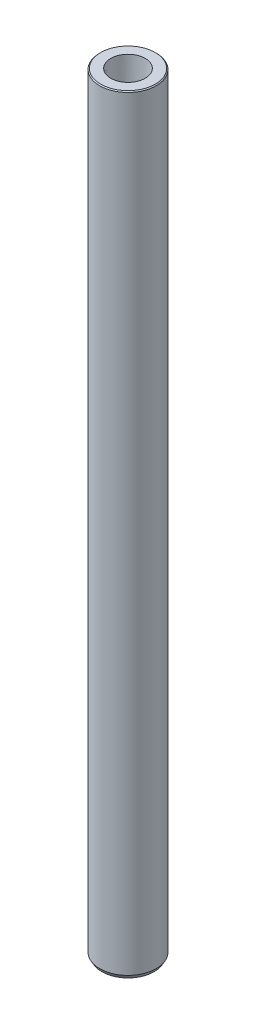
ISO-10303-21;
HEADER;
FILE_DESCRIPTION(('STEP AP214'),'2;1');
FILE_NAME('part.step','',(''),(''),'','','');
FILE_SCHEMA(('AUTOMOTIVE_DESIGN { 1 0 10303 214 1 1 1 1 }'));
ENDSEC;
DATA;
#1=APPLICATION_CONTEXT('core data for automotive mechanical design processes');
#2=APPLICATION_PROTOCOL_DEFINITION('international standard','automotive_design',2000,#1);
#3=PRODUCT_CONTEXT('',#1,'mechanical');
#4=PRODUCT('Part','Part','',(#3));
#5=PRODUCT_RELATED_PRODUCT_CATEGORY('part','',(#4));
#6=PRODUCT_DEFINITION_FORMATION('','',#4);
#7=PRODUCT_DEFINITION_CONTEXT('part definition',#1,'design');
#8=PRODUCT_DEFINITION('design','',#6,#7);
#9=PRODUCT_DEFINITION_SHAPE('','',#8);
#10=(LENGTH_UNIT() NAMED_UNIT(*) SI_UNIT(.MILLI.,.METRE.));
#11=(NAMED_UNIT(*) PLANE_ANGLE_UNIT() SI_UNIT($,.RADIAN.));
#12=(NAMED_UNIT(*) SI_UNIT($,.STERADIAN.) SOLID_ANGLE_UNIT());
#13=UNCERTAINTY_MEASURE_WITH_UNIT(LENGTH_MEASURE(1.E-05),#10,'distance_accuracy_value','');
#14=(GEOMETRIC_REPRESENTATION_CONTEXT(3) GLOBAL_UNCERTAINTY_ASSIGNED_CONTEXT((#13)) GLOBAL_UNIT_ASSIGNED_CONTEXT((#10,
#11,#12)) REPRESENTATION_CONTEXT('',''));
#15=CARTESIAN_POINT('',(0.,0.,0.));
#16=DIRECTION('',(0.,0.,1.));
#17=DIRECTION('',(1.,0.,0.));
#18=AXIS2_PLACEMENT_3D('',#15,#16,#17);
#19=CARTESIAN_POINT('',(0.,204.,0.));
#20=DIRECTION('',(0.,-1.,0.));
#21=DIRECTION('',(0.,0.,-1.));
#22=AXIS2_PLACEMENT_3D('',#19,#20,#21);
#23=CYLINDRICAL_SURFACE('',#22,7.5);
#24=CARTESIAN_POINT('',(0.,203.75,0.));
#25=DIRECTION('',(0.,1.,0.));
#26=DIRECTION('',(0.,0.,1.));
#27=AXIS2_PLACEMENT_3D('',#24,#25,#26);
#28=CIRCLE('',#27,7.5);
#29=CARTESIAN_POINT('',(0.,203.75,7.5));
#30=VERTEX_POINT('',#29);
#31=EDGE_CURVE('E9183',#30,#30,#28,.F.);
#32=ORIENTED_EDGE('',*,*,#31,.T.);
#33=EDGE_LOOP('',(#32));
#34=FACE_BOUND('',#33,.T.);
#35=CARTESIAN_POINT('',(0.,1.00000000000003,0.));
#36=DIRECTION('',(0.,1.,0.));
#37=DIRECTION('',(0.,0.,1.));
#38=AXIS2_PLACEMENT_3D('',#35,#36,#37);
#39=CIRCLE('',#38,7.5);
#40=CARTESIAN_POINT('',(0.,1.00000000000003,7.5));
#41=VERTEX_POINT('',#40);
#42=EDGE_CURVE('E9198',#41,#41,#39,.T.);
#43=ORIENTED_EDGE('',*,*,#42,.T.);
#44=EDGE_LOOP('',(#43));
#45=FACE_BOUND('',#44,.T.);
#46=ADVANCED_FACE('F9172',(#34,#45),#23,.T.);
#47=CARTESIAN_POINT('',(0.,204.,0.));
#48=DIRECTION('',(0.,1.,0.));
#49=DIRECTION('',(0.,0.,1.));
#50=AXIS2_PLACEMENT_3D('',#47,#48,#49);
#51=PLANE('',#50);
#52=CARTESIAN_POINT('',(0.,204.,0.));
#53=DIRECTION('',(0.,1.,0.));
#54=DIRECTION('',(0.,0.,1.));
#55=AXIS2_PLACEMENT_3D('',#52,#53,#54);
#56=CIRCLE('',#55,4.5735);
#57=CARTESIAN_POINT('',(0.,204.,4.5735));
#58=VERTEX_POINT('',#57);
#59=EDGE_CURVE('E9206',#58,#58,#56,.T.);
#60=ORIENTED_EDGE('',*,*,#59,.F.);
#61=EDGE_LOOP('',(#60));
#62=FACE_BOUND('',#61,.T.);
#63=CARTESIAN_POINT('',(0.,204.,0.));
#64=DIRECTION('',(0.,1.,0.));
#65=DIRECTION('',(0.,0.,1.));
#66=AXIS2_PLACEMENT_3D('',#63,#64,#65);
#67=CIRCLE('',#66,7.25);
#68=CARTESIAN_POINT('',(0.,204.,7.25));
#69=VERTEX_POINT('',#68);
#70=EDGE_CURVE('E9192',#69,#69,#67,.T.);
#71=ORIENTED_EDGE('',*,*,#70,.T.);
#72=EDGE_LOOP('',(#71));
#73=FACE_BOUND('',#72,.T.);
#74=ADVANCED_FACE('F9212',(#62,#73),#51,.T.);
#75=CARTESIAN_POINT('',(0.,0.,0.));
#76=DIRECTION('',(0.,1.,0.));
#77=DIRECTION('',(0.,0.,1.));
#78=AXIS2_PLACEMENT_3D('',#75,#76,#77);
#79=PLANE('',#78);
#80=CARTESIAN_POINT('',(0.,0.,0.));
#81=DIRECTION('',(0.,1.,0.));
#82=DIRECTION('',(0.,0.,1.));
#83=AXIS2_PLACEMENT_3D('',#80,#81,#82);
#84=CIRCLE('',#83,4.75);
#85=CARTESIAN_POINT('',(0.,0.,4.75));
#86=VERTEX_POINT('',#85);
#87=EDGE_CURVE('E10',#86,#86,#84,.T.);
#88=ORIENTED_EDGE('',*,*,#87,.T.);
#89=EDGE_LOOP('',(#88));
#90=FACE_BOUND('',#89,.T.);
#91=CARTESIAN_POINT('',(0.,0.,0.));
#92=DIRECTION('',(0.,1.,0.));
#93=DIRECTION('',(0.,0.,1.));
#94=AXIS2_PLACEMENT_3D('',#91,#92,#93);
#95=CIRCLE('',#94,6.92264973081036);
#96=CARTESIAN_POINT('',(0.,0.,6.92264973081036));
#97=VERTEX_POINT('',#96);
#98=EDGE_CURVE('E9195',#97,#97,#95,.F.);
#99=ORIENTED_EDGE('',*,*,#98,.T.);
#100=EDGE_LOOP('',(#99));
#101=FACE_BOUND('',#100,.T.);
#102=ADVANCED_FACE('F9215',(#90,#101),#79,.F.);
#103=CARTESIAN_POINT('',(0.,1.00000000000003,0.));
#104=DIRECTION('',(0.,1.,0.));
#105=DIRECTION('',(0.,0.,1.));
#106=AXIS2_PLACEMENT_3D('',#103,#104,#105);
#107=CONICAL_SURFACE('',#106,7.5,0.523598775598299);
#108=ORIENTED_EDGE('',*,*,#98,.F.);
#109=EDGE_LOOP('',(#108));
#110=FACE_BOUND('',#109,.T.);
#111=ORIENTED_EDGE('',*,*,#42,.F.);
#112=EDGE_LOOP('',(#111));
#113=FACE_BOUND('',#112,.T.);
#114=ADVANCED_FACE('F9243',(#110,#113),#107,.T.);
#115=CARTESIAN_POINT('',(0.,17.,0.));
#116=DIRECTION('',(0.,-1.,0.));
#117=DIRECTION('',(0.,0.,-1.));
#118=AXIS2_PLACEMENT_3D('',#115,#116,#117);
#119=CYLINDRICAL_SURFACE('',#118,4.5);
#120=CARTESIAN_POINT('',(0.,0.25,0.));
#121=DIRECTION('',(0.,1.,0.));
#122=DIRECTION('',(0.,0.,1.));
#123=AXIS2_PLACEMENT_3D('',#120,#121,#122);
#124=CIRCLE('',#123,4.5);
#125=CARTESIAN_POINT('',(0.,0.25,4.5));
#126=VERTEX_POINT('',#125);
#127=EDGE_CURVE('E9179',#126,#126,#124,.F.);
#128=ORIENTED_EDGE('',*,*,#127,.T.);
#129=EDGE_LOOP('',(#128));
#130=FACE_BOUND('',#129,.T.);
#131=CARTESIAN_POINT('',(0.,17.,0.));
#132=DIRECTION('',(0.,-1.,0.));
#133=DIRECTION('',(0.,0.,-1.));
#134=AXIS2_PLACEMENT_3D('',#131,#132,#133);
#135=CIRCLE('',#134,4.5);
#136=CARTESIAN_POINT('',(0.,17.,-4.5));
#137=VERTEX_POINT('',#136);
#138=EDGE_CURVE('E9189',#137,#137,#135,.T.);
#139=ORIENTED_EDGE('',*,*,#138,.F.);
#140=EDGE_LOOP('',(#139));
#141=FACE_BOUND('',#140,.T.);
#142=ADVANCED_FACE('F9232',(#130,#141),#119,.F.);
#143=CARTESIAN_POINT('',(0.,17.,0.));
#144=DIRECTION('',(0.,-1.,0.));
#145=DIRECTION('',(0.,0.,-1.));
#146=AXIS2_PLACEMENT_3D('',#143,#144,#145);
#147=PLANE('',#146);
#148=CARTESIAN_POINT('',(0.,17.,0.));
#149=DIRECTION('',(0.,-1.,0.));
#150=DIRECTION('',(0.,0.,-1.));
#151=AXIS2_PLACEMENT_3D('',#148,#149,#150);
#152=CIRCLE('',#151,4.);
#153=CARTESIAN_POINT('',(0.,17.,-4.));
#154=VERTEX_POINT('',#153);
#155=EDGE_CURVE('E9186',#154,#154,#152,.T.);
#156=ORIENTED_EDGE('',*,*,#155,.F.);
#157=EDGE_LOOP('',(#156));
#158=FACE_BOUND('',#157,.T.);
#159=ORIENTED_EDGE('',*,*,#138,.T.);
#160=EDGE_LOOP('',(#159));
#161=FACE_BOUND('',#160,.T.);
#162=ADVANCED_FACE('F9221',(#158,#161),#147,.T.);
#163=CARTESIAN_POINT('',(0.,204.,0.));
#164=DIRECTION('',(0.,-1.,0.));
#165=DIRECTION('',(0.,0.,-1.));
#166=AXIS2_PLACEMENT_3D('',#163,#164,#165);
#167=CONICAL_SURFACE('',#166,7.25,0.78539816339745);
#168=ORIENTED_EDGE('',*,*,#31,.F.);
#169=EDGE_LOOP('',(#168));
#170=FACE_BOUND('',#169,.T.);
#171=ORIENTED_EDGE('',*,*,#70,.F.);
#172=EDGE_LOOP('',(#171));
#173=FACE_BOUND('',#172,.T.);
#174=ADVANCED_FACE('F9218',(#170,#173),#167,.T.);
#175=CARTESIAN_POINT('',(0.,3.99999999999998,0.));
#176=DIRECTION('',(0.,1.,0.));
#177=DIRECTION('',(0.,0.,1.));
#178=AXIS2_PLACEMENT_3D('',#175,#176,#177);
#179=CYLINDRICAL_SURFACE('',#178,4.);
#180=CARTESIAN_POINT('',(0.,196.6,0.));
#181=DIRECTION('',(0.,-1.,0.));
#182=DIRECTION('',(0.,0.,-1.));
#183=AXIS2_PLACEMENT_3D('',#180,#181,#182);
#184=CIRCLE('',#183,4.);
#185=CARTESIAN_POINT('',(0.,196.6,-4.));
#186=VERTEX_POINT('',#185);
#187=EDGE_CURVE('E9175',#186,#186,#184,.F.);
#188=ORIENTED_EDGE('',*,*,#187,.T.);
#189=EDGE_LOOP('',(#188));
#190=FACE_BOUND('',#189,.T.);
#191=ORIENTED_EDGE('',*,*,#155,.T.);
#192=EDGE_LOOP('',(#191));
#193=FACE_BOUND('',#192,.T.);
#194=ADVANCED_FACE('F9220',(#190,#193),#179,.F.);
#195=CARTESIAN_POINT('',(0.,0.25,0.));
#196=DIRECTION('',(0.,-1.,0.));
#197=DIRECTION('',(0.,0.,-1.));
#198=AXIS2_PLACEMENT_3D('',#195,#196,#197);
#199=CONICAL_SURFACE('',#198,4.5,0.78539816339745);
#200=ORIENTED_EDGE('',*,*,#87,.F.);
#201=EDGE_LOOP('',(#200));
#202=FACE_BOUND('',#201,.T.);
#203=ORIENTED_EDGE('',*,*,#127,.F.);
#204=EDGE_LOOP('',(#203));
#205=FACE_BOUND('',#204,.T.);
#206=ADVANCED_FACE('F9229',(#202,#205),#199,.F.);
#207=CARTESIAN_POINT('',(3.95,196.6,0.));
#208=DIRECTION('',(0.,-1.,0.));
#209=DIRECTION('',(0.,0.,-1.));
#210=AXIS2_PLACEMENT_3D('',#207,#208,#209);
#211=PLANE('',#210);
#212=CARTESIAN_POINT('',(0.,196.6,0.));
#213=DIRECTION('',(0.,1.,0.));
#214=DIRECTION('',(0.,0.,1.));
#215=AXIS2_PLACEMENT_3D('',#212,#213,#214);
#216=CIRCLE('',#215,4.34249700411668);
#217=CARTESIAN_POINT('',(0.,196.6,4.34249700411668));
#218=VERTEX_POINT('',#217);
#219=EDGE_CURVE('E9203',#218,#218,#216,.T.);
#220=ORIENTED_EDGE('',*,*,#219,.T.);
#221=EDGE_LOOP('',(#220));
#222=FACE_BOUND('',#221,.T.);
#223=ORIENTED_EDGE('',*,*,#187,.F.);
#224=EDGE_LOOP('',(#223));
#225=FACE_BOUND('',#224,.T.);
#226=ADVANCED_FACE('F9269',(#222,#225),#211,.F.);
#227=CARTESIAN_POINT('',(0.,204.,0.));
#228=DIRECTION('',(0.,1.,0.));
#229=DIRECTION('',(0.,0.,1.));
#230=AXIS2_PLACEMENT_3D('',#227,#228,#229);
#231=CONICAL_SURFACE('',#230,4.5735,0.0312064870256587);
#232=ORIENTED_EDGE('',*,*,#219,.F.);
#233=EDGE_LOOP('',(#232));
#234=FACE_BOUND('',#233,.T.);
#235=ORIENTED_EDGE('',*,*,#59,.T.);
#236=EDGE_LOOP('',(#235));
#237=FACE_BOUND('',#236,.T.);
#238=ADVANCED_FACE('F9210',(#234,#237),#231,.F.);
#239=CLOSED_SHELL('',(#46,#74,#102,#114,#142,#162,#174,#194,#206,#226,#238));
#240=MANIFOLD_SOLID_BREP('B2',#239);
#241=ADVANCED_BREP_SHAPE_REPRESENTATION('',(#18,#240),#14);
#242=SHAPE_DEFINITION_REPRESENTATION(#9,#241);
ENDSEC;
END-ISO-10303-21;
